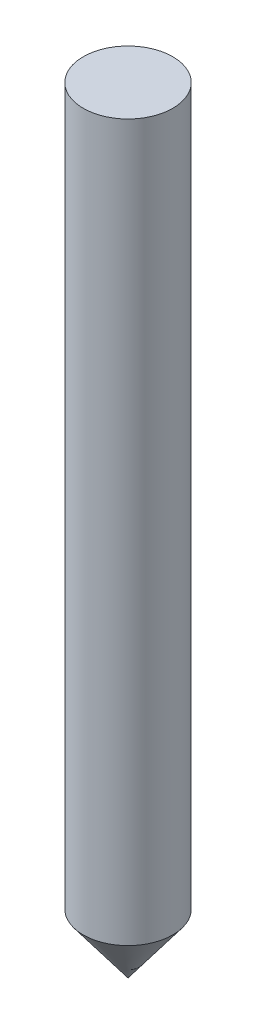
ISO-10303-21;
HEADER;
FILE_DESCRIPTION(('STEP AP214'),'2;1');
FILE_NAME('part.step','',(''),(''),'','','');
FILE_SCHEMA(('AUTOMOTIVE_DESIGN { 1 0 10303 214 1 1 1 1 }'));
ENDSEC;
DATA;
#1=APPLICATION_CONTEXT('core data for automotive mechanical design processes');
#2=APPLICATION_PROTOCOL_DEFINITION('international standard','automotive_design',2000,#1);
#3=PRODUCT_CONTEXT('',#1,'mechanical');
#4=PRODUCT('Part','Part','',(#3));
#5=PRODUCT_RELATED_PRODUCT_CATEGORY('part','',(#4));
#6=PRODUCT_DEFINITION_FORMATION('','',#4);
#7=PRODUCT_DEFINITION_CONTEXT('part definition',#1,'design');
#8=PRODUCT_DEFINITION('design','',#6,#7);
#9=PRODUCT_DEFINITION_SHAPE('','',#8);
#10=(LENGTH_UNIT() NAMED_UNIT(*) SI_UNIT(.MILLI.,.METRE.));
#11=(NAMED_UNIT(*) PLANE_ANGLE_UNIT() SI_UNIT($,.RADIAN.));
#12=(NAMED_UNIT(*) SI_UNIT($,.STERADIAN.) SOLID_ANGLE_UNIT());
#13=UNCERTAINTY_MEASURE_WITH_UNIT(LENGTH_MEASURE(1.E-05),#10,'distance_accuracy_value','');
#14=(GEOMETRIC_REPRESENTATION_CONTEXT(3) GLOBAL_UNCERTAINTY_ASSIGNED_CONTEXT((#13)) GLOBAL_UNIT_ASSIGNED_CONTEXT((#10,
#11,#12)) REPRESENTATION_CONTEXT('',''));
#15=CARTESIAN_POINT('',(0.,0.,0.));
#16=DIRECTION('',(0.,0.,1.));
#17=DIRECTION('',(1.,0.,0.));
#18=AXIS2_PLACEMENT_3D('',#15,#16,#17);
#19=CARTESIAN_POINT('',(0.,130.,0.));
#20=DIRECTION('',(0.,-1.,0.));
#21=DIRECTION('',(0.,0.,-1.));
#22=AXIS2_PLACEMENT_3D('',#19,#20,#21);
#23=PLANE('',#22);
#24=CARTESIAN_POINT('',(0.,130.,0.));
#25=DIRECTION('',(0.,-1.,0.));
#26=DIRECTION('',(0.,0.,-1.));
#27=AXIS2_PLACEMENT_3D('',#24,#25,#26);
#28=CIRCLE('',#27,7.5);
#29=CARTESIAN_POINT('',(0.,130.,-7.5));
#30=VERTEX_POINT('',#29);
#31=EDGE_CURVE('E13',#30,#30,#28,.T.);
#32=ORIENTED_EDGE('',*,*,#31,.F.);
#33=EDGE_LOOP('',(#32));
#34=FACE_BOUND('',#33,.T.);
#35=ADVANCED_FACE('F43',(#34),#23,.F.);
#36=CARTESIAN_POINT('',(0.,0.,0.));
#37=DIRECTION('',(0.,-1.,0.));
#38=DIRECTION('',(0.,0.,-1.));
#39=AXIS2_PLACEMENT_3D('',#36,#37,#38);
#40=CYLINDRICAL_SURFACE('',#39,7.49999999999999);
#41=CARTESIAN_POINT('',(0.,10.,0.));
#42=DIRECTION('',(0.,-1.,0.));
#43=DIRECTION('',(0.,0.,-1.));
#44=AXIS2_PLACEMENT_3D('',#41,#42,#43);
#45=CIRCLE('',#44,7.49999999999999);
#46=CARTESIAN_POINT('',(0.,10.,-7.49999999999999));
#47=VERTEX_POINT('',#46);
#48=EDGE_CURVE('E49',#47,#47,#45,.T.);
#49=ORIENTED_EDGE('',*,*,#48,.F.);
#50=EDGE_LOOP('',(#49));
#51=FACE_BOUND('',#50,.T.);
#52=ORIENTED_EDGE('',*,*,#31,.T.);
#53=EDGE_LOOP('',(#52));
#54=FACE_BOUND('',#53,.T.);
#55=ADVANCED_FACE('F55',(#51,#54),#40,.T.);
#56=CARTESIAN_POINT('',(0.,10.,0.));
#57=DIRECTION('',(0.,1.,0.));
#58=DIRECTION('',(0.,0.,1.));
#59=AXIS2_PLACEMENT_3D('',#56,#57,#58);
#60=CONICAL_SURFACE('',#59,7.49999999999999,0.643501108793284);
#61=CARTESIAN_POINT('',(0.,0.,0.));
#62=VERTEX_POINT('',#61);
#63=VERTEX_LOOP('',#62);
#64=FACE_BOUND('',#63,.T.);
#65=ORIENTED_EDGE('',*,*,#48,.T.);
#66=EDGE_LOOP('',(#65));
#67=FACE_BOUND('',#66,.T.);
#68=ADVANCED_FACE('F52',(#64,#67),#60,.T.);
#69=CLOSED_SHELL('',(#35,#55,#68));
#70=MANIFOLD_SOLID_BREP('B2',#69);
#71=ADVANCED_BREP_SHAPE_REPRESENTATION('',(#18,#70),#14);
#72=SHAPE_DEFINITION_REPRESENTATION(#9,#71);
ENDSEC;
END-ISO-10303-21;
